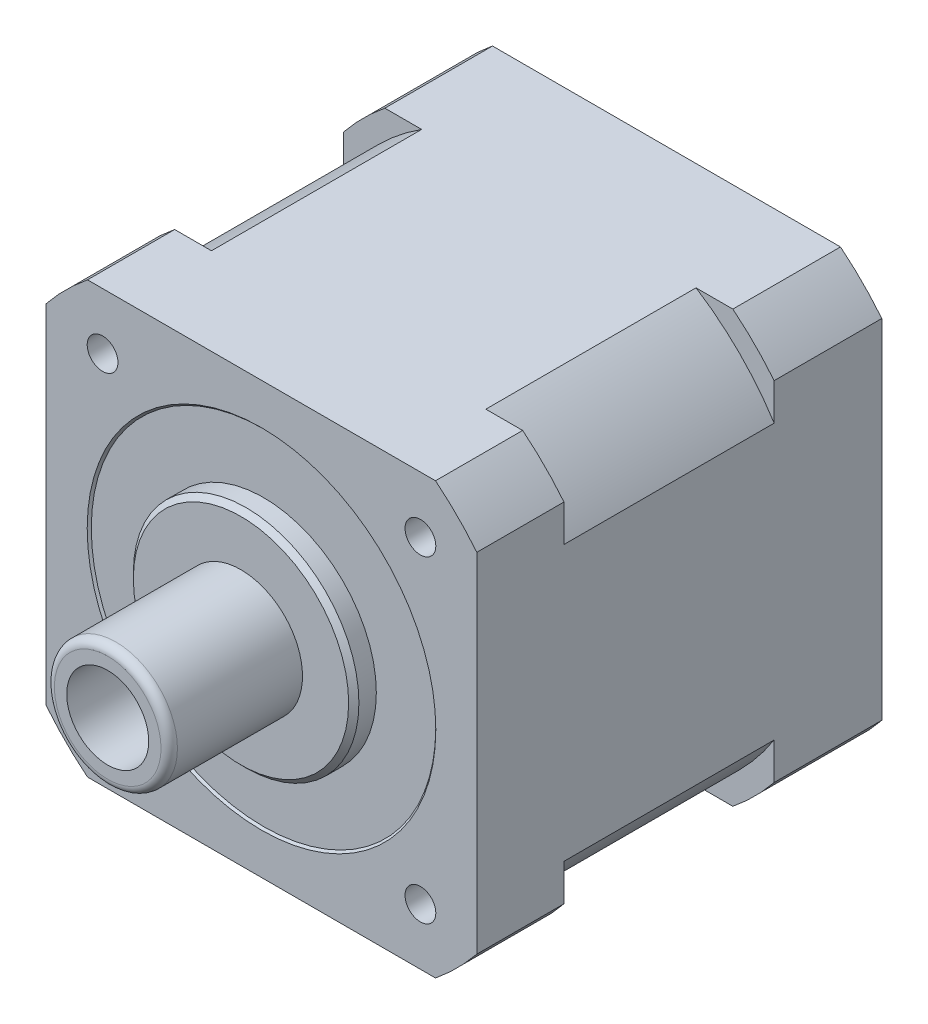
ISO-10303-21;
HEADER;
FILE_DESCRIPTION(('STEP AP214'),'2;1');
FILE_NAME('part.step','',(''),(''),'','','');
FILE_SCHEMA(('AUTOMOTIVE_DESIGN { 1 0 10303 214 1 1 1 1 }'));
ENDSEC;
DATA;
#1=APPLICATION_CONTEXT('core data for automotive mechanical design processes');
#2=APPLICATION_PROTOCOL_DEFINITION('international standard','automotive_design',2000,#1);
#3=PRODUCT_CONTEXT('',#1,'mechanical');
#4=PRODUCT('Part','Part','',(#3));
#5=PRODUCT_RELATED_PRODUCT_CATEGORY('part','',(#4));
#6=PRODUCT_DEFINITION_FORMATION('','',#4);
#7=PRODUCT_DEFINITION_CONTEXT('part definition',#1,'design');
#8=PRODUCT_DEFINITION('design','',#6,#7);
#9=PRODUCT_DEFINITION_SHAPE('','',#8);
#10=(LENGTH_UNIT() NAMED_UNIT(*) SI_UNIT(.MILLI.,.METRE.));
#11=(NAMED_UNIT(*) PLANE_ANGLE_UNIT() SI_UNIT($,.RADIAN.));
#12=(NAMED_UNIT(*) SI_UNIT($,.STERADIAN.) SOLID_ANGLE_UNIT());
#13=UNCERTAINTY_MEASURE_WITH_UNIT(LENGTH_MEASURE(1.E-05),#10,'distance_accuracy_value','');
#14=(GEOMETRIC_REPRESENTATION_CONTEXT(3) GLOBAL_UNCERTAINTY_ASSIGNED_CONTEXT((#13)) GLOBAL_UNIT_ASSIGNED_CONTEXT((#10,
#11,#12)) REPRESENTATION_CONTEXT('',''));
#15=CARTESIAN_POINT('',(0.,0.,0.));
#16=DIRECTION('',(0.,0.,1.));
#17=DIRECTION('',(1.,0.,0.));
#18=AXIS2_PLACEMENT_3D('',#15,#16,#17);
#19=CARTESIAN_POINT('',(0.,0.,-41.5));
#20=DIRECTION('',(0.,0.,-1.));
#21=DIRECTION('',(-1.,0.,0.));
#22=AXIS2_PLACEMENT_3D('',#19,#20,#21);
#23=PLANE('',#22);
#24=DIRECTION('',(0.,-1.,0.));
#25=VECTOR('',#24,1.);
#26=CARTESIAN_POINT('',(21.,0.,-41.5));
#27=LINE('',#26,#25);
#28=CARTESIAN_POINT('',(21.,16.9705627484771,-41.5));
#29=VERTEX_POINT('',#28);
#30=CARTESIAN_POINT('',(21.,-16.9705627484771,-41.5));
#31=VERTEX_POINT('',#30);
#32=EDGE_CURVE('E208',#29,#31,#27,.T.);
#33=ORIENTED_EDGE('',*,*,#32,.T.);
#34=CARTESIAN_POINT('',(0.,0.,-41.5));
#35=DIRECTION('',(0.,0.,-1.));
#36=DIRECTION('',(-1.,0.,0.));
#37=AXIS2_PLACEMENT_3D('',#34,#35,#36);
#38=CIRCLE('',#37,27.);
#39=CARTESIAN_POINT('',(16.9705627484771,-21.,-41.5));
#40=VERTEX_POINT('',#39);
#41=EDGE_CURVE('E198',#31,#40,#38,.T.);
#42=ORIENTED_EDGE('',*,*,#41,.T.);
#43=DIRECTION('',(-1.,0.,0.));
#44=VECTOR('',#43,1.);
#45=CARTESIAN_POINT('',(0.,-21.,-41.5));
#46=LINE('',#45,#44);
#47=CARTESIAN_POINT('',(-16.9705627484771,-21.,-41.5));
#48=VERTEX_POINT('',#47);
#49=EDGE_CURVE('E207',#40,#48,#46,.T.);
#50=ORIENTED_EDGE('',*,*,#49,.T.);
#51=CARTESIAN_POINT('',(0.,0.,-41.5));
#52=DIRECTION('',(0.,0.,-1.));
#53=DIRECTION('',(-1.,0.,0.));
#54=AXIS2_PLACEMENT_3D('',#51,#52,#53);
#55=CIRCLE('',#54,27.);
#56=CARTESIAN_POINT('',(-21.,-16.9705627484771,-41.5));
#57=VERTEX_POINT('',#56);
#58=EDGE_CURVE('E317',#48,#57,#55,.T.);
#59=ORIENTED_EDGE('',*,*,#58,.T.);
#60=DIRECTION('',(0.,1.,0.));
#61=VECTOR('',#60,1.);
#62=CARTESIAN_POINT('',(-21.,0.,-41.5));
#63=LINE('',#62,#61);
#64=CARTESIAN_POINT('',(-21.,16.9705627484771,-41.5));
#65=VERTEX_POINT('',#64);
#66=EDGE_CURVE('E335',#57,#65,#63,.T.);
#67=ORIENTED_EDGE('',*,*,#66,.T.);
#68=CARTESIAN_POINT('',(0.,0.,-41.5));
#69=DIRECTION('',(0.,0.,-1.));
#70=DIRECTION('',(-1.,0.,0.));
#71=AXIS2_PLACEMENT_3D('',#68,#69,#70);
#72=CIRCLE('',#71,27.);
#73=CARTESIAN_POINT('',(-16.9705627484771,21.,-41.5));
#74=VERTEX_POINT('',#73);
#75=EDGE_CURVE('E337',#65,#74,#72,.T.);
#76=ORIENTED_EDGE('',*,*,#75,.T.);
#77=DIRECTION('',(1.,0.,0.));
#78=VECTOR('',#77,1.);
#79=CARTESIAN_POINT('',(0.,21.,-41.5));
#80=LINE('',#79,#78);
#81=CARTESIAN_POINT('',(16.9705627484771,21.,-41.5));
#82=VERTEX_POINT('',#81);
#83=EDGE_CURVE('E302',#74,#82,#80,.T.);
#84=ORIENTED_EDGE('',*,*,#83,.T.);
#85=CARTESIAN_POINT('',(0.,0.,-41.5));
#86=DIRECTION('',(0.,0.,-1.));
#87=DIRECTION('',(-1.,0.,0.));
#88=AXIS2_PLACEMENT_3D('',#85,#86,#87);
#89=CIRCLE('',#88,27.);
#90=EDGE_CURVE('E213',#82,#29,#89,.T.);
#91=ORIENTED_EDGE('',*,*,#90,.T.);
#92=EDGE_LOOP('',(#33,#42,#50,#59,#67,#76,#84,#91));
#93=FACE_BOUND('',#92,.T.);
#94=CARTESIAN_POINT('',(0.,0.,-41.5));
#95=DIRECTION('',(0.,0.,-1.));
#96=DIRECTION('',(-1.,0.,0.));
#97=AXIS2_PLACEMENT_3D('',#94,#95,#96);
#98=CIRCLE('',#97,6.);
#99=CARTESIAN_POINT('',(-6.,0.,-41.5));
#100=VERTEX_POINT('',#99);
#101=EDGE_CURVE('E516',#100,#100,#98,.T.);
#102=ORIENTED_EDGE('',*,*,#101,.F.);
#103=EDGE_LOOP('',(#102));
#104=FACE_BOUND('',#103,.T.);
#105=ADVANCED_FACE('F36',(#93,#104),#23,.T.);
#106=CARTESIAN_POINT('',(0.,0.,13.));
#107=DIRECTION('',(0.,0.,-1.));
#108=DIRECTION('',(-1.,0.,0.));
#109=AXIS2_PLACEMENT_3D('',#106,#107,#108);
#110=CYLINDRICAL_SURFACE('',#109,6.);
#111=CARTESIAN_POINT('',(0.,0.,12.2));
#112=DIRECTION('',(0.,0.,1.));
#113=DIRECTION('',(1.,0.,0.));
#114=AXIS2_PLACEMENT_3D('',#111,#112,#113);
#115=CIRCLE('',#114,6.);
#116=CARTESIAN_POINT('',(-6.,0.,12.2));
#117=VERTEX_POINT('',#116);
#118=EDGE_CURVE('E12',#117,#117,#115,.F.);
#119=CARTESIAN_POINT('',(0.,0.,0.));
#120=DIRECTION('',(0.,0.,-1.));
#121=DIRECTION('',(-1.,0.,0.));
#122=AXIS2_PLACEMENT_3D('',#119,#120,#121);
#123=CIRCLE('',#122,6.);
#124=CARTESIAN_POINT('',(-6.,0.,0.));
#125=VERTEX_POINT('',#124);
#126=EDGE_CURVE('E431',#125,#125,#123,.T.);
#127=CARTESIAN_POINT('',(-6.,0.,12.2));
#128=CARTESIAN_POINT('',(-6.,0.,12.0729166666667));
#129=CARTESIAN_POINT('',(-6.,0.,11.9458333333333));
#130=CARTESIAN_POINT('',(-6.,0.,11.6916666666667));
#131=CARTESIAN_POINT('',(-6.,0.,11.5645833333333));
#132=CARTESIAN_POINT('',(-6.,0.,11.3104166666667));
#133=CARTESIAN_POINT('',(-6.,0.,11.1833333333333));
#134=CARTESIAN_POINT('',(-6.,0.,10.9291666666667));
#135=CARTESIAN_POINT('',(-6.,0.,10.8020833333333));
#136=CARTESIAN_POINT('',(-6.,0.,10.5479166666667));
#137=CARTESIAN_POINT('',(-6.,0.,10.4208333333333));
#138=CARTESIAN_POINT('',(-6.,0.,10.1666666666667));
#139=CARTESIAN_POINT('',(-6.,0.,10.0395833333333));
#140=CARTESIAN_POINT('',(-6.,0.,9.78541666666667));
#141=CARTESIAN_POINT('',(-6.,0.,9.65833333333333));
#142=CARTESIAN_POINT('',(-6.,0.,9.40416666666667));
#143=CARTESIAN_POINT('',(-6.,0.,9.27708333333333));
#144=CARTESIAN_POINT('',(-6.,0.,9.02291666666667));
#145=CARTESIAN_POINT('',(-6.,0.,8.89583333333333));
#146=CARTESIAN_POINT('',(-6.,0.,8.64166666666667));
#147=CARTESIAN_POINT('',(-6.,0.,8.51458333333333));
#148=CARTESIAN_POINT('',(-6.,0.,8.26041666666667));
#149=CARTESIAN_POINT('',(-6.,0.,8.13333333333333));
#150=CARTESIAN_POINT('',(-6.,0.,7.87916666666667));
#151=CARTESIAN_POINT('',(-6.,0.,7.75208333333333));
#152=CARTESIAN_POINT('',(-6.,0.,7.49791666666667));
#153=CARTESIAN_POINT('',(-6.,0.,7.37083333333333));
#154=CARTESIAN_POINT('',(-6.,0.,7.11666666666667));
#155=CARTESIAN_POINT('',(-6.,0.,6.98958333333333));
#156=CARTESIAN_POINT('',(-6.,0.,6.73541666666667));
#157=CARTESIAN_POINT('',(-6.,0.,6.60833333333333));
#158=CARTESIAN_POINT('',(-6.,0.,6.35416666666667));
#159=CARTESIAN_POINT('',(-6.,0.,6.22708333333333));
#160=CARTESIAN_POINT('',(-6.,0.,5.97291666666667));
#161=CARTESIAN_POINT('',(-6.,0.,5.84583333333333));
#162=CARTESIAN_POINT('',(-6.,0.,5.59166666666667));
#163=CARTESIAN_POINT('',(-6.,0.,5.46458333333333));
#164=CARTESIAN_POINT('',(-6.,0.,5.21041666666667));
#165=CARTESIAN_POINT('',(-6.,0.,5.08333333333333));
#166=CARTESIAN_POINT('',(-6.,0.,4.82916666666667));
#167=CARTESIAN_POINT('',(-6.,0.,4.70208333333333));
#168=CARTESIAN_POINT('',(-6.,0.,4.44791666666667));
#169=CARTESIAN_POINT('',(-6.,0.,4.32083333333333));
#170=CARTESIAN_POINT('',(-6.,0.,4.06666666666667));
#171=CARTESIAN_POINT('',(-6.,0.,3.93958333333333));
#172=CARTESIAN_POINT('',(-6.,0.,3.68541666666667));
#173=CARTESIAN_POINT('',(-6.,0.,3.55833333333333));
#174=CARTESIAN_POINT('',(-6.,0.,3.30416666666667));
#175=CARTESIAN_POINT('',(-6.,0.,3.17708333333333));
#176=CARTESIAN_POINT('',(-6.,0.,2.92291666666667));
#177=CARTESIAN_POINT('',(-6.,0.,2.79583333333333));
#178=CARTESIAN_POINT('',(-6.,0.,2.54166666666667));
#179=CARTESIAN_POINT('',(-6.,0.,2.41458333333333));
#180=CARTESIAN_POINT('',(-6.,0.,2.16041666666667));
#181=CARTESIAN_POINT('',(-6.,0.,2.03333333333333));
#182=CARTESIAN_POINT('',(-6.,0.,1.77916666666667));
#183=CARTESIAN_POINT('',(-6.,0.,1.65208333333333));
#184=CARTESIAN_POINT('',(-6.,0.,1.39791666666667));
#185=CARTESIAN_POINT('',(-6.,0.,1.27083333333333));
#186=CARTESIAN_POINT('',(-6.,0.,1.01666666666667));
#187=CARTESIAN_POINT('',(-6.,0.,0.889583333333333));
#188=CARTESIAN_POINT('',(-6.,0.,0.635416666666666));
#189=CARTESIAN_POINT('',(-6.,0.,0.508333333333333));
#190=CARTESIAN_POINT('',(-6.,0.,0.254166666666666));
#191=CARTESIAN_POINT('',(-6.,0.,0.127083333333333));
#192=CARTESIAN_POINT('',(-6.,0.,0.));
#193=B_SPLINE_CURVE_WITH_KNOTS('',3,(#127,#128,#129,#130,#131,#132,#133,#134,#135,#136,#137,
#138,#139,#140,#141,#142,#143,#144,#145,#146,#147,#148,#149,#150,#151,#152,#153,#154,#155,#156,
#157,#158,#159,#160,#161,#162,#163,#164,#165,#166,#167,#168,#169,#170,#171,#172,#173,#174,#175,
#176,#177,#178,#179,#180,#181,#182,#183,#184,#185,#186,#187,#188,#189,#190,#191,#192),
.UNSPECIFIED.,.F.,.F.,(4,2,2,2,2,2,2,2,2,2,2,2,2,2,2,2,2,2,2,2,2,2,2,2,2,2,2,2,2,2,2,2,4),(0.,
0.38125,0.762499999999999,1.14375,1.525,1.90625,2.2875,2.66875,3.05,3.43125,3.8125,4.19375,
4.575,4.95625,5.3375,5.71875,6.1,6.48125,6.8625,7.24375,7.625,8.00625,8.3875,8.76875,9.15,
9.53125,9.9125,10.29375,10.675,11.05625,11.4375,11.81875,12.2),.UNSPECIFIED.);
#194=EDGE_CURVE('BSEAM537',#117,#125,#193,.T.);
#195=ORIENTED_EDGE('',*,*,#118,.T.);
#196=ORIENTED_EDGE('',*,*,#126,.F.);
#197=ORIENTED_EDGE('',*,*,#194,.T.);
#198=ORIENTED_EDGE('',*,*,#194,.F.);
#199=EDGE_LOOP('',(#195,#197,#196,#198));
#200=FACE_BOUND('',#199,.T.);
#201=ADVANCED_FACE('F537',(#200),#110,.T.);
#202=CARTESIAN_POINT('',(0.,0.,13.));
#203=DIRECTION('',(0.,0.,1.));
#204=DIRECTION('',(1.,0.,0.));
#205=AXIS2_PLACEMENT_3D('',#202,#203,#204);
#206=PLANE('',#205);
#207=CARTESIAN_POINT('',(0.,0.,13.));
#208=DIRECTION('',(0.,0.,1.));
#209=DIRECTION('',(1.,0.,0.));
#210=AXIS2_PLACEMENT_3D('',#207,#208,#209);
#211=CIRCLE('',#210,4.);
#212=CARTESIAN_POINT('',(4.,0.,13.));
#213=VERTEX_POINT('',#212);
#214=EDGE_CURVE('E526',#213,#213,#211,.T.);
#215=ORIENTED_EDGE('',*,*,#214,.F.);
#216=EDGE_LOOP('',(#215));
#217=FACE_BOUND('',#216,.T.);
#218=CARTESIAN_POINT('',(0.,0.,13.));
#219=DIRECTION('',(0.,0.,1.));
#220=DIRECTION('',(1.,0.,0.));
#221=AXIS2_PLACEMENT_3D('',#218,#219,#220);
#222=CIRCLE('',#221,5.2);
#223=CARTESIAN_POINT('',(5.2,0.,13.));
#224=VERTEX_POINT('',#223);
#225=EDGE_CURVE('E44',#224,#224,#222,.T.);
#226=ORIENTED_EDGE('',*,*,#225,.T.);
#227=EDGE_LOOP('',(#226));
#228=FACE_BOUND('',#227,.T.);
#229=ADVANCED_FACE('F533',(#217,#228),#206,.T.);
#230=CARTESIAN_POINT('',(0.,0.,0.));
#231=DIRECTION('',(0.,0.,-1.));
#232=DIRECTION('',(-1.,0.,0.));
#233=AXIS2_PLACEMENT_3D('',#230,#231,#232);
#234=PLANE('',#233);
#235=CARTESIAN_POINT('',(0.,0.,0.));
#236=DIRECTION('',(0.,0.,-1.));
#237=DIRECTION('',(-1.,0.,0.));
#238=AXIS2_PLACEMENT_3D('',#235,#236,#237);
#239=CIRCLE('',#238,10.5);
#240=CARTESIAN_POINT('',(-10.5,0.,0.));
#241=VERTEX_POINT('',#240);
#242=EDGE_CURVE('E549',#241,#241,#239,.F.);
#243=ORIENTED_EDGE('',*,*,#242,.T.);
#244=EDGE_LOOP('',(#243));
#245=FACE_BOUND('',#244,.T.);
#246=ORIENTED_EDGE('',*,*,#126,.T.);
#247=EDGE_LOOP('',(#246));
#248=FACE_BOUND('',#247,.T.);
#249=ADVANCED_FACE('F536',(#245,#248),#234,.F.);
#250=CARTESIAN_POINT('',(0.,0.,-2.));
#251=DIRECTION('',(0.,0.,1.));
#252=DIRECTION('',(1.,0.,0.));
#253=AXIS2_PLACEMENT_3D('',#250,#251,#252);
#254=CYLINDRICAL_SURFACE('',#253,11.);
#255=CARTESIAN_POINT('',(0.,0.,-0.499999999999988));
#256=DIRECTION('',(0.,0.,-1.));
#257=DIRECTION('',(-1.,0.,0.));
#258=AXIS2_PLACEMENT_3D('',#255,#256,#257);
#259=CIRCLE('',#258,11.);
#260=CARTESIAN_POINT('',(-11.,0.,-0.499999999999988));
#261=VERTEX_POINT('',#260);
#262=EDGE_CURVE('E552',#261,#261,#259,.T.);
#263=ORIENTED_EDGE('',*,*,#262,.T.);
#264=EDGE_LOOP('',(#263));
#265=FACE_BOUND('',#264,.T.);
#266=CARTESIAN_POINT('',(0.,0.,-2.2));
#267=DIRECTION('',(0.,0.,1.));
#268=DIRECTION('',(1.,0.,0.));
#269=AXIS2_PLACEMENT_3D('',#266,#267,#268);
#270=CIRCLE('',#269,11.);
#271=CARTESIAN_POINT('',(11.,0.,-2.2));
#272=VERTEX_POINT('',#271);
#273=EDGE_CURVE('E514',#272,#272,#270,.T.);
#274=ORIENTED_EDGE('',*,*,#273,.T.);
#275=EDGE_LOOP('',(#274));
#276=FACE_BOUND('',#275,.T.);
#277=ADVANCED_FACE('F671',(#265,#276),#254,.T.);
#278=CARTESIAN_POINT('',(0.,0.,-2.2));
#279=DIRECTION('',(0.,0.,1.));
#280=DIRECTION('',(1.,0.,0.));
#281=AXIS2_PLACEMENT_3D('',#278,#279,#280);
#282=PLANE('',#281);
#283=CARTESIAN_POINT('',(0.,0.,-2.2));
#284=DIRECTION('',(0.,0.,1.));
#285=DIRECTION('',(1.,0.,0.));
#286=AXIS2_PLACEMENT_3D('',#283,#284,#285);
#287=CIRCLE('',#286,16.8);
#288=CARTESIAN_POINT('',(16.8,0.,-2.2));
#289=VERTEX_POINT('',#288);
#290=EDGE_CURVE('E555',#289,#289,#287,.T.);
#291=ORIENTED_EDGE('',*,*,#290,.T.);
#292=EDGE_LOOP('',(#291));
#293=FACE_BOUND('',#292,.T.);
#294=ORIENTED_EDGE('',*,*,#273,.F.);
#295=EDGE_LOOP('',(#294));
#296=FACE_BOUND('',#295,.T.);
#297=ADVANCED_FACE('F627',(#293,#296),#282,.T.);
#298=CARTESIAN_POINT('',(-21.,-21.,-10.5));
#299=DIRECTION('',(0.,0.,-1.));
#300=DIRECTION('',(-1.,0.,0.));
#301=AXIS2_PLACEMENT_3D('',#298,#299,#300);
#302=PLANE('',#301);
#303=CARTESIAN_POINT('',(0.,0.,-10.5));
#304=DIRECTION('',(0.,0.,-1.));
#305=DIRECTION('',(-1.,0.,0.));
#306=AXIS2_PLACEMENT_3D('',#303,#304,#305);
#307=CIRCLE('',#306,24.9);
#308=CARTESIAN_POINT('',(13.3794618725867,21.,-10.5));
#309=VERTEX_POINT('',#308);
#310=CARTESIAN_POINT('',(21.,13.3794618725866,-10.5));
#311=VERTEX_POINT('',#310);
#312=EDGE_CURVE('E384',#309,#311,#307,.T.);
#313=ORIENTED_EDGE('',*,*,#312,.F.);
#314=DIRECTION('',(1.,0.,0.));
#315=VECTOR('',#314,1.);
#316=CARTESIAN_POINT('',(21.,21.,-10.5));
#317=LINE('',#316,#315);
#318=CARTESIAN_POINT('',(16.9705627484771,21.,-10.5));
#319=VERTEX_POINT('',#318);
#320=EDGE_CURVE('E426',#309,#319,#317,.T.);
#321=ORIENTED_EDGE('',*,*,#320,.T.);
#322=CARTESIAN_POINT('',(0.,0.,-10.5));
#323=DIRECTION('',(0.,0.,-1.));
#324=DIRECTION('',(-1.,0.,0.));
#325=AXIS2_PLACEMENT_3D('',#322,#323,#324);
#326=CIRCLE('',#325,27.);
#327=CARTESIAN_POINT('',(21.,16.9705627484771,-10.5));
#328=VERTEX_POINT('',#327);
#329=EDGE_CURVE('E490',#319,#328,#326,.T.);
#330=ORIENTED_EDGE('',*,*,#329,.T.);
#331=DIRECTION('',(0.,-1.,0.));
#332=VECTOR('',#331,1.);
#333=CARTESIAN_POINT('',(21.,21.,-10.5));
#334=LINE('',#333,#332);
#335=EDGE_CURVE('E456',#328,#311,#334,.T.);
#336=ORIENTED_EDGE('',*,*,#335,.T.);
#337=EDGE_LOOP('',(#313,#321,#330,#336));
#338=FACE_BOUND('',#337,.T.);
#339=ADVANCED_FACE('F483',(#338),#302,.T.);
#340=CARTESIAN_POINT('',(0.,0.,-31.));
#341=DIRECTION('',(0.,0.,1.));
#342=DIRECTION('',(1.,0.,0.));
#343=AXIS2_PLACEMENT_3D('',#340,#341,#342);
#344=CYLINDRICAL_SURFACE('',#343,24.9);
#345=ORIENTED_EDGE('',*,*,#312,.T.);
#346=DIRECTION('',(0.,0.,1.));
#347=VECTOR('',#346,1.);
#348=CARTESIAN_POINT('',(21.,13.3794618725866,-31.));
#349=LINE('',#348,#347);
#350=CARTESIAN_POINT('',(21.,13.3794618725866,-31.));
#351=VERTEX_POINT('',#350);
#352=EDGE_CURVE('E301',#351,#311,#349,.T.);
#353=ORIENTED_EDGE('',*,*,#352,.F.);
#354=CARTESIAN_POINT('',(0.,0.,-31.));
#355=DIRECTION('',(0.,0.,-1.));
#356=DIRECTION('',(-1.,0.,0.));
#357=AXIS2_PLACEMENT_3D('',#354,#355,#356);
#358=CIRCLE('',#357,24.9);
#359=CARTESIAN_POINT('',(13.3794618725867,21.,-31.));
#360=VERTEX_POINT('',#359);
#361=EDGE_CURVE('E298',#360,#351,#358,.T.);
#362=ORIENTED_EDGE('',*,*,#361,.F.);
#363=DIRECTION('',(0.,0.,1.));
#364=VECTOR('',#363,1.);
#365=CARTESIAN_POINT('',(13.3794618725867,21.,-31.));
#366=LINE('',#365,#364);
#367=EDGE_CURVE('E286',#360,#309,#366,.T.);
#368=ORIENTED_EDGE('',*,*,#367,.T.);
#369=EDGE_LOOP('',(#345,#353,#362,#368));
#370=FACE_BOUND('',#369,.T.);
#371=ADVANCED_FACE('F481',(#370),#344,.T.);
#372=CARTESIAN_POINT('',(0.,0.,-31.));
#373=DIRECTION('',(0.,0.,-1.));
#374=DIRECTION('',(-1.,0.,0.));
#375=AXIS2_PLACEMENT_3D('',#372,#373,#374);
#376=PLANE('',#375);
#377=DIRECTION('',(1.,0.,0.));
#378=VECTOR('',#377,1.);
#379=CARTESIAN_POINT('',(0.,21.,-31.));
#380=LINE('',#379,#378);
#381=CARTESIAN_POINT('',(16.9705627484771,21.,-31.));
#382=VERTEX_POINT('',#381);
#383=EDGE_CURVE('E266',#360,#382,#380,.T.);
#384=ORIENTED_EDGE('',*,*,#383,.F.);
#385=ORIENTED_EDGE('',*,*,#361,.T.);
#386=DIRECTION('',(0.,-1.,0.));
#387=VECTOR('',#386,1.);
#388=CARTESIAN_POINT('',(21.,0.,-31.));
#389=LINE('',#388,#387);
#390=CARTESIAN_POINT('',(21.,16.9705627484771,-31.));
#391=VERTEX_POINT('',#390);
#392=EDGE_CURVE('E233',#391,#351,#389,.T.);
#393=ORIENTED_EDGE('',*,*,#392,.F.);
#394=CARTESIAN_POINT('',(0.,0.,-31.));
#395=DIRECTION('',(0.,0.,-1.));
#396=DIRECTION('',(-1.,0.,0.));
#397=AXIS2_PLACEMENT_3D('',#394,#395,#396);
#398=CIRCLE('',#397,27.);
#399=EDGE_CURVE('E217',#382,#391,#398,.T.);
#400=ORIENTED_EDGE('',*,*,#399,.F.);
#401=EDGE_LOOP('',(#384,#385,#393,#400));
#402=FACE_BOUND('',#401,.T.);
#403=ADVANCED_FACE('F297',(#402),#376,.F.);
#404=CARTESIAN_POINT('',(0.,0.,-41.5));
#405=DIRECTION('',(0.,0.,1.));
#406=DIRECTION('',(1.,0.,0.));
#407=AXIS2_PLACEMENT_3D('',#404,#405,#406);
#408=CYLINDRICAL_SURFACE('',#407,27.);
#409=ORIENTED_EDGE('',*,*,#399,.T.);
#410=DIRECTION('',(0.,0.,1.));
#411=VECTOR('',#410,1.);
#412=CARTESIAN_POINT('',(21.,16.9705627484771,-41.5));
#413=LINE('',#412,#411);
#414=EDGE_CURVE('E294',#29,#391,#413,.T.);
#415=ORIENTED_EDGE('',*,*,#414,.F.);
#416=ORIENTED_EDGE('',*,*,#90,.F.);
#417=DIRECTION('',(0.,0.,1.));
#418=VECTOR('',#417,1.);
#419=CARTESIAN_POINT('',(16.9705627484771,21.,-41.5));
#420=LINE('',#419,#418);
#421=EDGE_CURVE('E283',#82,#382,#420,.T.);
#422=ORIENTED_EDGE('',*,*,#421,.T.);
#423=EDGE_LOOP('',(#409,#415,#416,#422));
#424=FACE_BOUND('',#423,.T.);
#425=ADVANCED_FACE('F292',(#424),#408,.T.);
#426=CARTESIAN_POINT('',(0.,0.,-10.5));
#427=DIRECTION('',(0.,0.,-1.));
#428=DIRECTION('',(-1.,0.,0.));
#429=AXIS2_PLACEMENT_3D('',#426,#427,#428);
#430=CIRCLE('',#429,24.9);
#431=CARTESIAN_POINT('',(21.,-13.3794618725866,-10.5));
#432=VERTEX_POINT('',#431);
#433=CARTESIAN_POINT('',(13.3794618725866,-21.,-10.5));
#434=VERTEX_POINT('',#433);
#435=EDGE_CURVE('E373',#432,#434,#430,.T.);
#436=ORIENTED_EDGE('',*,*,#435,.F.);
#437=CARTESIAN_POINT('',(21.,-16.9705627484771,-10.5));
#438=VERTEX_POINT('',#437);
#439=EDGE_CURVE('E454',#432,#438,#334,.T.);
#440=ORIENTED_EDGE('',*,*,#439,.T.);
#441=CARTESIAN_POINT('',(16.9705627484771,-21.,-10.5));
#442=VERTEX_POINT('',#441);
#443=EDGE_CURVE('E430',#438,#442,#326,.T.);
#444=ORIENTED_EDGE('',*,*,#443,.T.);
#445=DIRECTION('',(-1.,0.,0.));
#446=VECTOR('',#445,1.);
#447=CARTESIAN_POINT('',(21.,-21.,-10.5));
#448=LINE('',#447,#446);
#449=EDGE_CURVE('E59',#442,#434,#448,.T.);
#450=ORIENTED_EDGE('',*,*,#449,.T.);
#451=EDGE_LOOP('',(#436,#440,#444,#450));
#452=FACE_BOUND('',#451,.T.);
#453=ADVANCED_FACE('F500',(#452),#302,.T.);
#454=CARTESIAN_POINT('',(0.,0.,-31.));
#455=DIRECTION('',(0.,0.,1.));
#456=DIRECTION('',(1.,0.,0.));
#457=AXIS2_PLACEMENT_3D('',#454,#455,#456);
#458=CYLINDRICAL_SURFACE('',#457,24.9);
#459=ORIENTED_EDGE('',*,*,#435,.T.);
#460=DIRECTION('',(0.,0.,1.));
#461=VECTOR('',#460,1.);
#462=CARTESIAN_POINT('',(13.3794618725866,-21.,-31.));
#463=LINE('',#462,#461);
#464=CARTESIAN_POINT('',(13.3794618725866,-21.,-31.));
#465=VERTEX_POINT('',#464);
#466=EDGE_CURVE('E505',#465,#434,#463,.T.);
#467=ORIENTED_EDGE('',*,*,#466,.F.);
#468=CARTESIAN_POINT('',(0.,0.,-31.));
#469=DIRECTION('',(0.,0.,-1.));
#470=DIRECTION('',(-1.,0.,0.));
#471=AXIS2_PLACEMENT_3D('',#468,#469,#470);
#472=CIRCLE('',#471,24.9);
#473=CARTESIAN_POINT('',(21.,-13.3794618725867,-31.));
#474=VERTEX_POINT('',#473);
#475=EDGE_CURVE('E356',#474,#465,#472,.T.);
#476=ORIENTED_EDGE('',*,*,#475,.F.);
#477=DIRECTION('',(0.,0.,1.));
#478=VECTOR('',#477,1.);
#479=CARTESIAN_POINT('',(21.,-13.3794618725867,-31.));
#480=LINE('',#479,#478);
#481=EDGE_CURVE('E354',#474,#432,#480,.T.);
#482=ORIENTED_EDGE('',*,*,#481,.T.);
#483=EDGE_LOOP('',(#459,#467,#476,#482));
#484=FACE_BOUND('',#483,.T.);
#485=ADVANCED_FACE('F511',(#484),#458,.T.);
#486=CARTESIAN_POINT('',(21.,-16.9705627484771,-31.));
#487=VERTEX_POINT('',#486);
#488=EDGE_CURVE('E222',#474,#487,#389,.T.);
#489=ORIENTED_EDGE('',*,*,#488,.F.);
#490=ORIENTED_EDGE('',*,*,#475,.T.);
#491=DIRECTION('',(-1.,0.,0.));
#492=VECTOR('',#491,1.);
#493=CARTESIAN_POINT('',(0.,-21.,-31.));
#494=LINE('',#493,#492);
#495=CARTESIAN_POINT('',(16.9705627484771,-21.,-31.));
#496=VERTEX_POINT('',#495);
#497=EDGE_CURVE('E254',#496,#465,#494,.T.);
#498=ORIENTED_EDGE('',*,*,#497,.F.);
#499=CARTESIAN_POINT('',(0.,0.,-31.));
#500=DIRECTION('',(0.,0.,-1.));
#501=DIRECTION('',(-1.,0.,0.));
#502=AXIS2_PLACEMENT_3D('',#499,#500,#501);
#503=CIRCLE('',#502,27.);
#504=EDGE_CURVE('E237',#487,#496,#503,.T.);
#505=ORIENTED_EDGE('',*,*,#504,.F.);
#506=EDGE_LOOP('',(#489,#490,#498,#505));
#507=FACE_BOUND('',#506,.T.);
#508=ADVANCED_FACE('F513',(#507),#376,.F.);
#509=CARTESIAN_POINT('',(0.,0.,-41.5));
#510=DIRECTION('',(0.,0.,1.));
#511=DIRECTION('',(1.,0.,0.));
#512=AXIS2_PLACEMENT_3D('',#509,#510,#511);
#513=CYLINDRICAL_SURFACE('',#512,27.);
#514=ORIENTED_EDGE('',*,*,#504,.T.);
#515=DIRECTION('',(0.,0.,1.));
#516=VECTOR('',#515,1.);
#517=CARTESIAN_POINT('',(16.9705627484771,-21.,-41.5));
#518=LINE('',#517,#516);
#519=EDGE_CURVE('E204',#40,#496,#518,.T.);
#520=ORIENTED_EDGE('',*,*,#519,.F.);
#521=ORIENTED_EDGE('',*,*,#41,.F.);
#522=DIRECTION('',(0.,0.,1.));
#523=VECTOR('',#522,1.);
#524=CARTESIAN_POINT('',(21.,-16.9705627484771,-41.5));
#525=LINE('',#524,#523);
#526=EDGE_CURVE('E202',#31,#487,#525,.T.);
#527=ORIENTED_EDGE('',*,*,#526,.T.);
#528=EDGE_LOOP('',(#514,#520,#521,#527));
#529=FACE_BOUND('',#528,.T.);
#530=ADVANCED_FACE('F200',(#529),#513,.T.);
#531=CARTESIAN_POINT('',(0.,0.,-10.5));
#532=DIRECTION('',(0.,0.,-1.));
#533=DIRECTION('',(-1.,0.,0.));
#534=AXIS2_PLACEMENT_3D('',#531,#532,#533);
#535=CIRCLE('',#534,24.9);
#536=CARTESIAN_POINT('',(-13.3794618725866,-21.,-10.5));
#537=VERTEX_POINT('',#536);
#538=CARTESIAN_POINT('',(-21.,-13.3794618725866,-10.5));
#539=VERTEX_POINT('',#538);
#540=EDGE_CURVE('E51',#537,#539,#535,.T.);
#541=ORIENTED_EDGE('',*,*,#540,.F.);
#542=CARTESIAN_POINT('',(-16.9705627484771,-21.,-10.5));
#543=VERTEX_POINT('',#542);
#544=EDGE_CURVE('E450',#537,#543,#448,.T.);
#545=ORIENTED_EDGE('',*,*,#544,.T.);
#546=CARTESIAN_POINT('',(-21.,-16.9705627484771,-10.5));
#547=VERTEX_POINT('',#546);
#548=EDGE_CURVE('E427',#543,#547,#326,.T.);
#549=ORIENTED_EDGE('',*,*,#548,.T.);
#550=DIRECTION('',(0.,1.,0.));
#551=VECTOR('',#550,1.);
#552=CARTESIAN_POINT('',(-21.,21.,-10.5));
#553=LINE('',#552,#551);
#554=EDGE_CURVE('E424',#547,#539,#553,.T.);
#555=ORIENTED_EDGE('',*,*,#554,.T.);
#556=EDGE_LOOP('',(#541,#545,#549,#555));
#557=FACE_BOUND('',#556,.T.);
#558=ADVANCED_FACE('F640',(#557),#302,.T.);
#559=CARTESIAN_POINT('',(0.,0.,-31.));
#560=DIRECTION('',(0.,0.,1.));
#561=DIRECTION('',(1.,0.,0.));
#562=AXIS2_PLACEMENT_3D('',#559,#560,#561);
#563=CYLINDRICAL_SURFACE('',#562,24.9);
#564=ORIENTED_EDGE('',*,*,#540,.T.);
#565=DIRECTION('',(0.,0.,1.));
#566=VECTOR('',#565,1.);
#567=CARTESIAN_POINT('',(-21.,-13.3794618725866,-31.));
#568=LINE('',#567,#566);
#569=CARTESIAN_POINT('',(-21.,-13.3794618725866,-31.));
#570=VERTEX_POINT('',#569);
#571=EDGE_CURVE('E332',#570,#539,#568,.T.);
#572=ORIENTED_EDGE('',*,*,#571,.F.);
#573=CARTESIAN_POINT('',(0.,0.,-31.));
#574=DIRECTION('',(0.,0.,-1.));
#575=DIRECTION('',(-1.,0.,0.));
#576=AXIS2_PLACEMENT_3D('',#573,#574,#575);
#577=CIRCLE('',#576,24.9);
#578=CARTESIAN_POINT('',(-13.3794618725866,-21.,-31.));
#579=VERTEX_POINT('',#578);
#580=EDGE_CURVE('E326',#579,#570,#577,.T.);
#581=ORIENTED_EDGE('',*,*,#580,.F.);
#582=DIRECTION('',(0.,0.,1.));
#583=VECTOR('',#582,1.);
#584=CARTESIAN_POINT('',(-13.3794618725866,-21.,-31.));
#585=LINE('',#584,#583);
#586=EDGE_CURVE('E510',#579,#537,#585,.T.);
#587=ORIENTED_EDGE('',*,*,#586,.T.);
#588=EDGE_LOOP('',(#564,#572,#581,#587));
#589=FACE_BOUND('',#588,.T.);
#590=ADVANCED_FACE('F665',(#589),#563,.T.);
#591=CARTESIAN_POINT('',(-16.9705627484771,-21.,-31.));
#592=VERTEX_POINT('',#591);
#593=EDGE_CURVE('E245',#579,#592,#494,.T.);
#594=ORIENTED_EDGE('',*,*,#593,.F.);
#595=ORIENTED_EDGE('',*,*,#580,.T.);
#596=DIRECTION('',(0.,1.,0.));
#597=VECTOR('',#596,1.);
#598=CARTESIAN_POINT('',(-21.,0.,-31.));
#599=LINE('',#598,#597);
#600=CARTESIAN_POINT('',(-21.,-16.9705627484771,-31.));
#601=VERTEX_POINT('',#600);
#602=EDGE_CURVE('E259',#601,#570,#599,.T.);
#603=ORIENTED_EDGE('',*,*,#602,.F.);
#604=CARTESIAN_POINT('',(0.,0.,-31.));
#605=DIRECTION('',(0.,0.,-1.));
#606=DIRECTION('',(-1.,0.,0.));
#607=AXIS2_PLACEMENT_3D('',#604,#605,#606);
#608=CIRCLE('',#607,27.);
#609=EDGE_CURVE('E248',#592,#601,#608,.T.);
#610=ORIENTED_EDGE('',*,*,#609,.F.);
#611=EDGE_LOOP('',(#594,#595,#603,#610));
#612=FACE_BOUND('',#611,.T.);
#613=ADVANCED_FACE('F322',(#612),#376,.F.);
#614=CARTESIAN_POINT('',(0.,0.,-41.5));
#615=DIRECTION('',(0.,0.,1.));
#616=DIRECTION('',(1.,0.,0.));
#617=AXIS2_PLACEMENT_3D('',#614,#615,#616);
#618=CYLINDRICAL_SURFACE('',#617,27.);
#619=ORIENTED_EDGE('',*,*,#609,.T.);
#620=DIRECTION('',(0.,0.,1.));
#621=VECTOR('',#620,1.);
#622=CARTESIAN_POINT('',(-21.,-16.9705627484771,-41.5));
#623=LINE('',#622,#621);
#624=EDGE_CURVE('E308',#57,#601,#623,.T.);
#625=ORIENTED_EDGE('',*,*,#624,.F.);
#626=ORIENTED_EDGE('',*,*,#58,.F.);
#627=DIRECTION('',(0.,0.,1.));
#628=VECTOR('',#627,1.);
#629=CARTESIAN_POINT('',(-16.9705627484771,-21.,-41.5));
#630=LINE('',#629,#628);
#631=EDGE_CURVE('E229',#48,#592,#630,.T.);
#632=ORIENTED_EDGE('',*,*,#631,.T.);
#633=EDGE_LOOP('',(#619,#625,#626,#632));
#634=FACE_BOUND('',#633,.T.);
#635=ADVANCED_FACE('F315',(#634),#618,.T.);
#636=CARTESIAN_POINT('',(0.,0.,-41.5));
#637=DIRECTION('',(0.,0.,1.));
#638=DIRECTION('',(1.,0.,0.));
#639=AXIS2_PLACEMENT_3D('',#636,#637,#638);
#640=CYLINDRICAL_SURFACE('',#639,27.);
#641=CARTESIAN_POINT('',(0.,0.,-31.));
#642=DIRECTION('',(0.,0.,-1.));
#643=DIRECTION('',(-1.,0.,0.));
#644=AXIS2_PLACEMENT_3D('',#641,#642,#643);
#645=CIRCLE('',#644,27.);
#646=CARTESIAN_POINT('',(-21.,16.9705627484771,-31.));
#647=VERTEX_POINT('',#646);
#648=CARTESIAN_POINT('',(-16.9705627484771,21.,-31.));
#649=VERTEX_POINT('',#648);
#650=EDGE_CURVE('E263',#647,#649,#645,.T.);
#651=ORIENTED_EDGE('',*,*,#650,.T.);
#652=DIRECTION('',(0.,0.,1.));
#653=VECTOR('',#652,1.);
#654=CARTESIAN_POINT('',(-16.9705627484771,21.,-41.5));
#655=LINE('',#654,#653);
#656=EDGE_CURVE('E293',#74,#649,#655,.T.);
#657=ORIENTED_EDGE('',*,*,#656,.F.);
#658=ORIENTED_EDGE('',*,*,#75,.F.);
#659=DIRECTION('',(0.,0.,1.));
#660=VECTOR('',#659,1.);
#661=CARTESIAN_POINT('',(-21.,16.9705627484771,-41.5));
#662=LINE('',#661,#660);
#663=EDGE_CURVE('E305',#65,#647,#662,.T.);
#664=ORIENTED_EDGE('',*,*,#663,.T.);
#665=EDGE_LOOP('',(#651,#657,#658,#664));
#666=FACE_BOUND('',#665,.T.);
#667=ADVANCED_FACE('F633',(#666),#640,.T.);
#668=CARTESIAN_POINT('',(-21.,13.3794618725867,-31.));
#669=VERTEX_POINT('',#668);
#670=EDGE_CURVE('E257',#669,#647,#599,.T.);
#671=ORIENTED_EDGE('',*,*,#670,.F.);
#672=CARTESIAN_POINT('',(0.,0.,-31.));
#673=DIRECTION('',(0.,0.,-1.));
#674=DIRECTION('',(-1.,0.,0.));
#675=AXIS2_PLACEMENT_3D('',#672,#673,#674);
#676=CIRCLE('',#675,24.9);
#677=CARTESIAN_POINT('',(-13.3794618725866,21.,-31.));
#678=VERTEX_POINT('',#677);
#679=EDGE_CURVE('E350',#669,#678,#676,.T.);
#680=ORIENTED_EDGE('',*,*,#679,.T.);
#681=EDGE_CURVE('E271',#649,#678,#380,.T.);
#682=ORIENTED_EDGE('',*,*,#681,.F.);
#683=ORIENTED_EDGE('',*,*,#650,.F.);
#684=EDGE_LOOP('',(#671,#680,#682,#683));
#685=FACE_BOUND('',#684,.T.);
#686=ADVANCED_FACE('F348',(#685),#376,.F.);
#687=CARTESIAN_POINT('',(0.,0.,-31.));
#688=DIRECTION('',(0.,0.,1.));
#689=DIRECTION('',(1.,0.,0.));
#690=AXIS2_PLACEMENT_3D('',#687,#688,#689);
#691=CYLINDRICAL_SURFACE('',#690,24.9);
#692=CARTESIAN_POINT('',(0.,0.,-10.5));
#693=DIRECTION('',(0.,0.,-1.));
#694=DIRECTION('',(-1.,0.,0.));
#695=AXIS2_PLACEMENT_3D('',#692,#693,#694);
#696=CIRCLE('',#695,24.9);
#697=CARTESIAN_POINT('',(-21.,13.3794618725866,-10.5));
#698=VERTEX_POINT('',#697);
#699=CARTESIAN_POINT('',(-13.3794618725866,21.,-10.5));
#700=VERTEX_POINT('',#699);
#701=EDGE_CURVE('E388',#698,#700,#696,.T.);
#702=ORIENTED_EDGE('',*,*,#701,.T.);
#703=DIRECTION('',(0.,0.,1.));
#704=VECTOR('',#703,1.);
#705=CARTESIAN_POINT('',(-13.3794618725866,21.,-31.));
#706=LINE('',#705,#704);
#707=EDGE_CURVE('E468',#678,#700,#706,.T.);
#708=ORIENTED_EDGE('',*,*,#707,.F.);
#709=ORIENTED_EDGE('',*,*,#679,.F.);
#710=DIRECTION('',(0.,0.,1.));
#711=VECTOR('',#710,1.);
#712=CARTESIAN_POINT('',(-21.,13.3794618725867,-31.));
#713=LINE('',#712,#711);
#714=EDGE_CURVE('E469',#669,#698,#713,.T.);
#715=ORIENTED_EDGE('',*,*,#714,.T.);
#716=EDGE_LOOP('',(#702,#708,#709,#715));
#717=FACE_BOUND('',#716,.T.);
#718=ADVANCED_FACE('F467',(#717),#691,.T.);
#719=ORIENTED_EDGE('',*,*,#701,.F.);
#720=CARTESIAN_POINT('',(-21.,16.9705627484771,-10.5));
#721=VERTEX_POINT('',#720);
#722=EDGE_CURVE('E421',#698,#721,#553,.T.);
#723=ORIENTED_EDGE('',*,*,#722,.T.);
#724=CARTESIAN_POINT('',(-16.9705627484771,21.,-10.5));
#725=VERTEX_POINT('',#724);
#726=EDGE_CURVE('E432',#721,#725,#326,.T.);
#727=ORIENTED_EDGE('',*,*,#726,.T.);
#728=EDGE_CURVE('E457',#725,#700,#317,.T.);
#729=ORIENTED_EDGE('',*,*,#728,.T.);
#730=EDGE_LOOP('',(#719,#723,#727,#729));
#731=FACE_BOUND('',#730,.T.);
#732=ADVANCED_FACE('F463',(#731),#302,.T.);
#733=CARTESIAN_POINT('',(-15.5,15.5,-6.5));
#734=DIRECTION('',(0.,0.,1.));
#735=DIRECTION('',(1.,0.,0.));
#736=AXIS2_PLACEMENT_3D('',#733,#734,#735);
#737=PLANE('',#736);
#738=CARTESIAN_POINT('',(-15.5,15.5,-6.5));
#739=DIRECTION('',(0.,0.,1.));
#740=DIRECTION('',(1.,0.,0.));
#741=AXIS2_PLACEMENT_3D('',#738,#739,#740);
#742=CIRCLE('',#741,1.5);
#743=CARTESIAN_POINT('',(-14.,15.5,-6.5));
#744=VERTEX_POINT('',#743);
#745=EDGE_CURVE('E377',#744,#744,#742,.T.);
#746=ORIENTED_EDGE('',*,*,#745,.T.);
#747=EDGE_LOOP('',(#746));
#748=FACE_BOUND('',#747,.T.);
#749=ADVANCED_FACE('F652',(#748),#737,.T.);
#750=CARTESIAN_POINT('',(15.5,15.5,-6.5));
#751=DIRECTION('',(0.,0.,1.));
#752=DIRECTION('',(1.,0.,0.));
#753=AXIS2_PLACEMENT_3D('',#750,#751,#752);
#754=PLANE('',#753);
#755=CARTESIAN_POINT('',(15.5,15.5,-6.5));
#756=DIRECTION('',(0.,0.,1.));
#757=DIRECTION('',(1.,0.,0.));
#758=AXIS2_PLACEMENT_3D('',#755,#756,#757);
#759=CIRCLE('',#758,1.5);
#760=CARTESIAN_POINT('',(17.,15.5,-6.5));
#761=VERTEX_POINT('',#760);
#762=EDGE_CURVE('E564',#761,#761,#759,.T.);
#763=ORIENTED_EDGE('',*,*,#762,.T.);
#764=EDGE_LOOP('',(#763));
#765=FACE_BOUND('',#764,.T.);
#766=ADVANCED_FACE('F646',(#765),#754,.T.);
#767=CARTESIAN_POINT('',(15.5,-15.5,-6.5));
#768=DIRECTION('',(0.,0.,1.));
#769=DIRECTION('',(1.,0.,0.));
#770=AXIS2_PLACEMENT_3D('',#767,#768,#769);
#771=PLANE('',#770);
#772=CARTESIAN_POINT('',(15.5,-15.5,-6.5));
#773=DIRECTION('',(0.,0.,1.));
#774=DIRECTION('',(1.,0.,0.));
#775=AXIS2_PLACEMENT_3D('',#772,#773,#774);
#776=CIRCLE('',#775,1.5);
#777=CARTESIAN_POINT('',(17.,-15.5,-6.5));
#778=VERTEX_POINT('',#777);
#779=EDGE_CURVE('E570',#778,#778,#776,.T.);
#780=ORIENTED_EDGE('',*,*,#779,.T.);
#781=EDGE_LOOP('',(#780));
#782=FACE_BOUND('',#781,.T.);
#783=ADVANCED_FACE('F642',(#782),#771,.T.);
#784=CARTESIAN_POINT('',(-15.5,-15.5,-6.5));
#785=DIRECTION('',(0.,0.,1.));
#786=DIRECTION('',(1.,0.,0.));
#787=AXIS2_PLACEMENT_3D('',#784,#785,#786);
#788=PLANE('',#787);
#789=CARTESIAN_POINT('',(-15.5,-15.5,-6.5));
#790=DIRECTION('',(0.,0.,1.));
#791=DIRECTION('',(1.,0.,0.));
#792=AXIS2_PLACEMENT_3D('',#789,#790,#791);
#793=CIRCLE('',#792,1.5);
#794=CARTESIAN_POINT('',(-14.,-15.5,-6.5));
#795=VERTEX_POINT('',#794);
#796=EDGE_CURVE('E227',#795,#795,#793,.T.);
#797=ORIENTED_EDGE('',*,*,#796,.T.);
#798=EDGE_LOOP('',(#797));
#799=FACE_BOUND('',#798,.T.);
#800=ADVANCED_FACE('F580',(#799),#788,.T.);
#801=CARTESIAN_POINT('',(21.,21.,-10.5));
#802=DIRECTION('',(0.,-1.,0.));
#803=DIRECTION('',(0.,0.,-1.));
#804=AXIS2_PLACEMENT_3D('',#801,#802,#803);
#805=PLANE('',#804);
#806=DIRECTION('',(0.,0.,1.));
#807=VECTOR('',#806,1.);
#808=CARTESIAN_POINT('',(16.9705627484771,21.,-36.));
#809=LINE('',#808,#807);
#810=CARTESIAN_POINT('',(16.9705627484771,21.,-2.));
#811=VERTEX_POINT('',#810);
#812=EDGE_CURVE('E408',#319,#811,#809,.T.);
#813=ORIENTED_EDGE('',*,*,#812,.F.);
#814=ORIENTED_EDGE('',*,*,#320,.F.);
#815=ORIENTED_EDGE('',*,*,#367,.F.);
#816=ORIENTED_EDGE('',*,*,#383,.T.);
#817=ORIENTED_EDGE('',*,*,#421,.F.);
#818=ORIENTED_EDGE('',*,*,#83,.F.);
#819=ORIENTED_EDGE('',*,*,#656,.T.);
#820=ORIENTED_EDGE('',*,*,#681,.T.);
#821=ORIENTED_EDGE('',*,*,#707,.T.);
#822=ORIENTED_EDGE('',*,*,#728,.F.);
#823=DIRECTION('',(0.,0.,1.));
#824=VECTOR('',#823,1.);
#825=CARTESIAN_POINT('',(-16.9705627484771,21.,-36.));
#826=LINE('',#825,#824);
#827=CARTESIAN_POINT('',(-16.9705627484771,21.,-2.));
#828=VERTEX_POINT('',#827);
#829=EDGE_CURVE('E410',#828,#725,#826,.F.);
#830=ORIENTED_EDGE('',*,*,#829,.F.);
#831=DIRECTION('',(1.,0.,0.));
#832=VECTOR('',#831,1.);
#833=CARTESIAN_POINT('',(21.,21.,-2.));
#834=LINE('',#833,#832);
#835=EDGE_CURVE('E441',#828,#811,#834,.T.);
#836=ORIENTED_EDGE('',*,*,#835,.T.);
#837=EDGE_LOOP('',(#813,#814,#815,#816,#817,#818,#819,#820,#821,#822,#830,#836));
#838=FACE_BOUND('',#837,.T.);
#839=ADVANCED_FACE('F281',(#838),#805,.F.);
#840=CARTESIAN_POINT('',(0.,0.,-36.));
#841=DIRECTION('',(0.,0.,1.));
#842=DIRECTION('',(1.,0.,0.));
#843=AXIS2_PLACEMENT_3D('',#840,#841,#842);
#844=CYLINDRICAL_SURFACE('',#843,27.);
#845=ORIENTED_EDGE('',*,*,#812,.T.);
#846=CARTESIAN_POINT('',(0.,0.,-2.));
#847=DIRECTION('',(0.,0.,1.));
#848=DIRECTION('',(1.,0.,0.));
#849=AXIS2_PLACEMENT_3D('',#846,#847,#848);
#850=CIRCLE('',#849,27.);
#851=CARTESIAN_POINT('',(21.,16.9705627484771,-2.));
#852=VERTEX_POINT('',#851);
#853=EDGE_CURVE('E393',#852,#811,#850,.T.);
#854=ORIENTED_EDGE('',*,*,#853,.F.);
#855=DIRECTION('',(0.,0.,1.));
#856=VECTOR('',#855,1.);
#857=CARTESIAN_POINT('',(21.,16.9705627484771,-36.));
#858=LINE('',#857,#856);
#859=EDGE_CURVE('E406',#852,#328,#858,.F.);
#860=ORIENTED_EDGE('',*,*,#859,.T.);
#861=ORIENTED_EDGE('',*,*,#329,.F.);
#862=EDGE_LOOP('',(#845,#854,#860,#861));
#863=FACE_BOUND('',#862,.T.);
#864=ADVANCED_FACE('F488',(#863),#844,.T.);
#865=CARTESIAN_POINT('',(21.,21.,-10.5));
#866=DIRECTION('',(-1.,0.,0.));
#867=DIRECTION('',(0.,-1.,0.));
#868=AXIS2_PLACEMENT_3D('',#865,#866,#867);
#869=PLANE('',#868);
#870=DIRECTION('',(0.,0.,1.));
#871=VECTOR('',#870,1.);
#872=CARTESIAN_POINT('',(21.,-16.9705627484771,-36.));
#873=LINE('',#872,#871);
#874=CARTESIAN_POINT('',(21.,-16.9705627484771,-2.));
#875=VERTEX_POINT('',#874);
#876=EDGE_CURVE('E404',#438,#875,#873,.T.);
#877=ORIENTED_EDGE('',*,*,#876,.F.);
#878=ORIENTED_EDGE('',*,*,#439,.F.);
#879=ORIENTED_EDGE('',*,*,#481,.F.);
#880=ORIENTED_EDGE('',*,*,#488,.T.);
#881=ORIENTED_EDGE('',*,*,#526,.F.);
#882=ORIENTED_EDGE('',*,*,#32,.F.);
#883=ORIENTED_EDGE('',*,*,#414,.T.);
#884=ORIENTED_EDGE('',*,*,#392,.T.);
#885=ORIENTED_EDGE('',*,*,#352,.T.);
#886=ORIENTED_EDGE('',*,*,#335,.F.);
#887=ORIENTED_EDGE('',*,*,#859,.F.);
#888=DIRECTION('',(0.,-1.,0.));
#889=VECTOR('',#888,1.);
#890=CARTESIAN_POINT('',(21.,21.,-2.));
#891=LINE('',#890,#889);
#892=EDGE_CURVE('E438',#852,#875,#891,.T.);
#893=ORIENTED_EDGE('',*,*,#892,.T.);
#894=EDGE_LOOP('',(#877,#878,#879,#880,#881,#882,#883,#884,#885,#886,#887,#893));
#895=FACE_BOUND('',#894,.T.);
#896=ADVANCED_FACE('F220',(#895),#869,.F.);
#897=ORIENTED_EDGE('',*,*,#876,.T.);
#898=CARTESIAN_POINT('',(16.9705627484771,-21.,-2.));
#899=VERTEX_POINT('',#898);
#900=EDGE_CURVE('E398',#899,#875,#850,.T.);
#901=ORIENTED_EDGE('',*,*,#900,.F.);
#902=DIRECTION('',(0.,0.,1.));
#903=VECTOR('',#902,1.);
#904=CARTESIAN_POINT('',(16.9705627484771,-21.,-36.));
#905=LINE('',#904,#903);
#906=EDGE_CURVE('E402',#899,#442,#905,.F.);
#907=ORIENTED_EDGE('',*,*,#906,.T.);
#908=ORIENTED_EDGE('',*,*,#443,.F.);
#909=EDGE_LOOP('',(#897,#901,#907,#908));
#910=FACE_BOUND('',#909,.T.);
#911=ADVANCED_FACE('F700',(#910),#844,.T.);
#912=CARTESIAN_POINT('',(21.,-21.,-10.5));
#913=DIRECTION('',(0.,1.,0.));
#914=DIRECTION('',(-1.,0.,0.));
#915=AXIS2_PLACEMENT_3D('',#912,#913,#914);
#916=PLANE('',#915);
#917=DIRECTION('',(0.,0.,1.));
#918=VECTOR('',#917,1.);
#919=CARTESIAN_POINT('',(-16.9705627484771,-21.,-36.));
#920=LINE('',#919,#918);
#921=CARTESIAN_POINT('',(-16.9705627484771,-21.,-2.));
#922=VERTEX_POINT('',#921);
#923=EDGE_CURVE('E396',#543,#922,#920,.T.);
#924=ORIENTED_EDGE('',*,*,#923,.F.);
#925=ORIENTED_EDGE('',*,*,#544,.F.);
#926=ORIENTED_EDGE('',*,*,#586,.F.);
#927=ORIENTED_EDGE('',*,*,#593,.T.);
#928=ORIENTED_EDGE('',*,*,#631,.F.);
#929=ORIENTED_EDGE('',*,*,#49,.F.);
#930=ORIENTED_EDGE('',*,*,#519,.T.);
#931=ORIENTED_EDGE('',*,*,#497,.T.);
#932=ORIENTED_EDGE('',*,*,#466,.T.);
#933=ORIENTED_EDGE('',*,*,#449,.F.);
#934=ORIENTED_EDGE('',*,*,#906,.F.);
#935=DIRECTION('',(-1.,0.,0.));
#936=VECTOR('',#935,1.);
#937=CARTESIAN_POINT('',(21.,-21.,-2.));
#938=LINE('',#937,#936);
#939=EDGE_CURVE('E435',#899,#922,#938,.T.);
#940=ORIENTED_EDGE('',*,*,#939,.T.);
#941=EDGE_LOOP('',(#924,#925,#926,#927,#928,#929,#930,#931,#932,#933,#934,#940));
#942=FACE_BOUND('',#941,.T.);
#943=ADVANCED_FACE('F504',(#942),#916,.F.);
#944=DIRECTION('',(0.,0.,1.));
#945=VECTOR('',#944,1.);
#946=CARTESIAN_POINT('',(-21.,-16.9705627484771,-36.));
#947=LINE('',#946,#945);
#948=CARTESIAN_POINT('',(-21.,-16.9705627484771,-2.));
#949=VERTEX_POINT('',#948);
#950=EDGE_CURVE('E400',#949,#547,#947,.F.);
#951=ORIENTED_EDGE('',*,*,#950,.T.);
#952=ORIENTED_EDGE('',*,*,#548,.F.);
#953=ORIENTED_EDGE('',*,*,#923,.T.);
#954=EDGE_CURVE('E697',#949,#922,#850,.T.);
#955=ORIENTED_EDGE('',*,*,#954,.F.);
#956=EDGE_LOOP('',(#951,#952,#953,#955));
#957=FACE_BOUND('',#956,.T.);
#958=ADVANCED_FACE('F614',(#957),#844,.T.);
#959=CARTESIAN_POINT('',(-21.,21.,-10.5));
#960=DIRECTION('',(1.,0.,0.));
#961=DIRECTION('',(0.,1.,0.));
#962=AXIS2_PLACEMENT_3D('',#959,#960,#961);
#963=PLANE('',#962);
#964=DIRECTION('',(0.,0.,1.));
#965=VECTOR('',#964,1.);
#966=CARTESIAN_POINT('',(-21.,16.9705627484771,-36.));
#967=LINE('',#966,#965);
#968=CARTESIAN_POINT('',(-21.,16.9705627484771,-2.));
#969=VERTEX_POINT('',#968);
#970=EDGE_CURVE('E412',#721,#969,#967,.T.);
#971=ORIENTED_EDGE('',*,*,#970,.F.);
#972=ORIENTED_EDGE('',*,*,#722,.F.);
#973=ORIENTED_EDGE('',*,*,#714,.F.);
#974=ORIENTED_EDGE('',*,*,#670,.T.);
#975=ORIENTED_EDGE('',*,*,#663,.F.);
#976=ORIENTED_EDGE('',*,*,#66,.F.);
#977=ORIENTED_EDGE('',*,*,#624,.T.);
#978=ORIENTED_EDGE('',*,*,#602,.T.);
#979=ORIENTED_EDGE('',*,*,#571,.T.);
#980=ORIENTED_EDGE('',*,*,#554,.F.);
#981=ORIENTED_EDGE('',*,*,#950,.F.);
#982=DIRECTION('',(0.,1.,0.));
#983=VECTOR('',#982,1.);
#984=CARTESIAN_POINT('',(-21.,21.,-2.));
#985=LINE('',#984,#983);
#986=EDGE_CURVE('E414',#949,#969,#985,.T.);
#987=ORIENTED_EDGE('',*,*,#986,.T.);
#988=EDGE_LOOP('',(#971,#972,#973,#974,#975,#976,#977,#978,#979,#980,#981,#987));
#989=FACE_BOUND('',#988,.T.);
#990=ADVANCED_FACE('F330',(#989),#963,.F.);
#991=ORIENTED_EDGE('',*,*,#970,.T.);
#992=EDGE_CURVE('E397',#828,#969,#850,.T.);
#993=ORIENTED_EDGE('',*,*,#992,.F.);
#994=ORIENTED_EDGE('',*,*,#829,.T.);
#995=ORIENTED_EDGE('',*,*,#726,.F.);
#996=EDGE_LOOP('',(#991,#993,#994,#995));
#997=FACE_BOUND('',#996,.T.);
#998=ADVANCED_FACE('F603',(#997),#844,.T.);
#999=CARTESIAN_POINT('',(-15.5,15.5,-6.5));
#1000=DIRECTION('',(0.,0.,1.));
#1001=DIRECTION('',(1.,0.,0.));
#1002=AXIS2_PLACEMENT_3D('',#999,#1000,#1001);
#1003=CYLINDRICAL_SURFACE('',#1002,1.5);
#1004=ORIENTED_EDGE('',*,*,#745,.F.);
#1005=EDGE_LOOP('',(#1004));
#1006=FACE_BOUND('',#1005,.T.);
#1007=CARTESIAN_POINT('',(-15.5,15.5,-2.));
#1008=DIRECTION('',(0.,0.,1.));
#1009=DIRECTION('',(1.,0.,0.));
#1010=AXIS2_PLACEMENT_3D('',#1007,#1008,#1009);
#1011=CIRCLE('',#1010,1.5);
#1012=CARTESIAN_POINT('',(-14.,15.5,-2.));
#1013=VERTEX_POINT('',#1012);
#1014=EDGE_CURVE('E561',#1013,#1013,#1011,.T.);
#1015=ORIENTED_EDGE('',*,*,#1014,.T.);
#1016=EDGE_LOOP('',(#1015));
#1017=FACE_BOUND('',#1016,.T.);
#1018=ADVANCED_FACE('F600',(#1006,#1017),#1003,.F.);
#1019=CARTESIAN_POINT('',(15.5,15.5,-6.5));
#1020=DIRECTION('',(0.,0.,1.));
#1021=DIRECTION('',(1.,0.,0.));
#1022=AXIS2_PLACEMENT_3D('',#1019,#1020,#1021);
#1023=CYLINDRICAL_SURFACE('',#1022,1.5);
#1024=ORIENTED_EDGE('',*,*,#762,.F.);
#1025=EDGE_LOOP('',(#1024));
#1026=FACE_BOUND('',#1025,.T.);
#1027=CARTESIAN_POINT('',(15.5,15.5,-2.));
#1028=DIRECTION('',(0.,0.,1.));
#1029=DIRECTION('',(1.,0.,0.));
#1030=AXIS2_PLACEMENT_3D('',#1027,#1028,#1029);
#1031=CIRCLE('',#1030,1.5);
#1032=CARTESIAN_POINT('',(17.,15.5,-2.));
#1033=VERTEX_POINT('',#1032);
#1034=EDGE_CURVE('E567',#1033,#1033,#1031,.T.);
#1035=ORIENTED_EDGE('',*,*,#1034,.T.);
#1036=EDGE_LOOP('',(#1035));
#1037=FACE_BOUND('',#1036,.T.);
#1038=ADVANCED_FACE('F602',(#1026,#1037),#1023,.F.);
#1039=CARTESIAN_POINT('',(15.5,-15.5,-6.5));
#1040=DIRECTION('',(0.,0.,1.));
#1041=DIRECTION('',(1.,0.,0.));
#1042=AXIS2_PLACEMENT_3D('',#1039,#1040,#1041);
#1043=CYLINDRICAL_SURFACE('',#1042,1.5);
#1044=ORIENTED_EDGE('',*,*,#779,.F.);
#1045=EDGE_LOOP('',(#1044));
#1046=FACE_BOUND('',#1045,.T.);
#1047=CARTESIAN_POINT('',(15.5,-15.5,-2.));
#1048=DIRECTION('',(0.,0.,1.));
#1049=DIRECTION('',(1.,0.,0.));
#1050=AXIS2_PLACEMENT_3D('',#1047,#1048,#1049);
#1051=CIRCLE('',#1050,1.5);
#1052=CARTESIAN_POINT('',(17.,-15.5,-2.));
#1053=VERTEX_POINT('',#1052);
#1054=EDGE_CURVE('E573',#1053,#1053,#1051,.T.);
#1055=ORIENTED_EDGE('',*,*,#1054,.T.);
#1056=EDGE_LOOP('',(#1055));
#1057=FACE_BOUND('',#1056,.T.);
#1058=ADVANCED_FACE('F585',(#1046,#1057),#1043,.F.);
#1059=CARTESIAN_POINT('',(-15.5,-15.5,-6.5));
#1060=DIRECTION('',(0.,0.,1.));
#1061=DIRECTION('',(1.,0.,0.));
#1062=AXIS2_PLACEMENT_3D('',#1059,#1060,#1061);
#1063=CYLINDRICAL_SURFACE('',#1062,1.5);
#1064=ORIENTED_EDGE('',*,*,#796,.F.);
#1065=EDGE_LOOP('',(#1064));
#1066=FACE_BOUND('',#1065,.T.);
#1067=CARTESIAN_POINT('',(-15.5,-15.5,-2.));
#1068=DIRECTION('',(0.,0.,1.));
#1069=DIRECTION('',(1.,0.,0.));
#1070=AXIS2_PLACEMENT_3D('',#1067,#1068,#1069);
#1071=CIRCLE('',#1070,1.5);
#1072=CARTESIAN_POINT('',(-14.,-15.5,-2.));
#1073=VERTEX_POINT('',#1072);
#1074=EDGE_CURVE('E224',#1073,#1073,#1071,.T.);
#1075=ORIENTED_EDGE('',*,*,#1074,.T.);
#1076=EDGE_LOOP('',(#1075));
#1077=FACE_BOUND('',#1076,.T.);
#1078=ADVANCED_FACE('F582',(#1066,#1077),#1063,.F.);
#1079=CARTESIAN_POINT('',(-21.,-21.,-2.));
#1080=DIRECTION('',(0.,0.,-1.));
#1081=DIRECTION('',(-1.,0.,0.));
#1082=AXIS2_PLACEMENT_3D('',#1079,#1080,#1081);
#1083=PLANE('',#1082);
#1084=CARTESIAN_POINT('',(0.,0.,-2.));
#1085=DIRECTION('',(0.,0.,-1.));
#1086=DIRECTION('',(-1.,0.,0.));
#1087=AXIS2_PLACEMENT_3D('',#1084,#1085,#1086);
#1088=CIRCLE('',#1087,17.);
#1089=CARTESIAN_POINT('',(-17.,0.,-2.));
#1090=VERTEX_POINT('',#1089);
#1091=EDGE_CURVE('E498',#1090,#1090,#1088,.T.);
#1092=ORIENTED_EDGE('',*,*,#1091,.T.);
#1093=EDGE_LOOP('',(#1092));
#1094=FACE_BOUND('',#1093,.T.);
#1095=ORIENTED_EDGE('',*,*,#1074,.F.);
#1096=EDGE_LOOP('',(#1095));
#1097=FACE_BOUND('',#1096,.T.);
#1098=ORIENTED_EDGE('',*,*,#1054,.F.);
#1099=EDGE_LOOP('',(#1098));
#1100=FACE_BOUND('',#1099,.T.);
#1101=ORIENTED_EDGE('',*,*,#1034,.F.);
#1102=EDGE_LOOP('',(#1101));
#1103=FACE_BOUND('',#1102,.T.);
#1104=ORIENTED_EDGE('',*,*,#1014,.F.);
#1105=EDGE_LOOP('',(#1104));
#1106=FACE_BOUND('',#1105,.T.);
#1107=ORIENTED_EDGE('',*,*,#992,.T.);
#1108=ORIENTED_EDGE('',*,*,#986,.F.);
#1109=ORIENTED_EDGE('',*,*,#954,.T.);
#1110=ORIENTED_EDGE('',*,*,#939,.F.);
#1111=ORIENTED_EDGE('',*,*,#900,.T.);
#1112=ORIENTED_EDGE('',*,*,#892,.F.);
#1113=ORIENTED_EDGE('',*,*,#853,.T.);
#1114=ORIENTED_EDGE('',*,*,#835,.F.);
#1115=EDGE_LOOP('',(#1107,#1108,#1109,#1110,#1111,#1112,#1113,#1114));
#1116=FACE_BOUND('',#1115,.T.);
#1117=ADVANCED_FACE('F494',(#1094,#1097,#1100,#1103,#1106,#1116),#1083,.F.);
#1118=CARTESIAN_POINT('',(0.,0.,-2.50000000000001));
#1119=DIRECTION('',(0.,0.,1.));
#1120=DIRECTION('',(1.,0.,0.));
#1121=AXIS2_PLACEMENT_3D('',#1118,#1119,#1120);
#1122=CONICAL_SURFACE('',#1121,16.5,0.785398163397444);
#1123=ORIENTED_EDGE('',*,*,#1091,.F.);
#1124=EDGE_LOOP('',(#1123));
#1125=FACE_BOUND('',#1124,.T.);
#1126=ORIENTED_EDGE('',*,*,#290,.F.);
#1127=EDGE_LOOP('',(#1126));
#1128=FACE_BOUND('',#1127,.T.);
#1129=ADVANCED_FACE('F591',(#1125,#1128),#1122,.F.);
#1130=CARTESIAN_POINT('',(0.,0.,-0.499999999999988));
#1131=DIRECTION('',(0.,0.,-1.));
#1132=DIRECTION('',(-1.,0.,0.));
#1133=AXIS2_PLACEMENT_3D('',#1130,#1131,#1132);
#1134=CONICAL_SURFACE('',#1133,11.,0.78539816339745);
#1135=ORIENTED_EDGE('',*,*,#242,.F.);
#1136=EDGE_LOOP('',(#1135));
#1137=FACE_BOUND('',#1136,.T.);
#1138=ORIENTED_EDGE('',*,*,#262,.F.);
#1139=EDGE_LOOP('',(#1138));
#1140=FACE_BOUND('',#1139,.T.);
#1141=ADVANCED_FACE('F728',(#1137,#1140),#1134,.T.);
#1142=CARTESIAN_POINT('',(0.,0.,-56.5));
#1143=DIRECTION('',(0.,0.,1.));
#1144=DIRECTION('',(1.,0.,0.));
#1145=AXIS2_PLACEMENT_3D('',#1142,#1143,#1144);
#1146=CYLINDRICAL_SURFACE('',#1145,6.);
#1147=CARTESIAN_POINT('',(0.,0.,-55.7));
#1148=DIRECTION('',(0.,0.,-1.));
#1149=DIRECTION('',(-1.,0.,0.));
#1150=AXIS2_PLACEMENT_3D('',#1147,#1148,#1149);
#1151=CIRCLE('',#1150,6.);
#1152=CARTESIAN_POINT('',(-6.,0.,-55.7));
#1153=VERTEX_POINT('',#1152);
#1154=EDGE_CURVE('E542',#1153,#1153,#1151,.F.);
#1155=ORIENTED_EDGE('',*,*,#1154,.T.);
#1156=EDGE_LOOP('',(#1155));
#1157=FACE_BOUND('',#1156,.T.);
#1158=ORIENTED_EDGE('',*,*,#101,.T.);
#1159=EDGE_LOOP('',(#1158));
#1160=FACE_BOUND('',#1159,.T.);
#1161=ADVANCED_FACE('F731',(#1157,#1160),#1146,.T.);
#1162=CARTESIAN_POINT('',(0.,0.,-56.5));
#1163=DIRECTION('',(0.,0.,-1.));
#1164=DIRECTION('',(-1.,0.,0.));
#1165=AXIS2_PLACEMENT_3D('',#1162,#1163,#1164);
#1166=PLANE('',#1165);
#1167=CARTESIAN_POINT('',(0.,0.,-56.5));
#1168=DIRECTION('',(0.,0.,-1.));
#1169=DIRECTION('',(-1.,0.,0.));
#1170=AXIS2_PLACEMENT_3D('',#1167,#1168,#1169);
#1171=CIRCLE('',#1170,4.);
#1172=CARTESIAN_POINT('',(4.,0.,-56.5));
#1173=VERTEX_POINT('',#1172);
#1174=EDGE_CURVE('E521',#1173,#1173,#1171,.F.);
#1175=ORIENTED_EDGE('',*,*,#1174,.T.);
#1176=EDGE_LOOP('',(#1175));
#1177=FACE_BOUND('',#1176,.T.);
#1178=CARTESIAN_POINT('',(0.,0.,-56.5));
#1179=DIRECTION('',(0.,0.,-1.));
#1180=DIRECTION('',(-1.,0.,0.));
#1181=AXIS2_PLACEMENT_3D('',#1178,#1179,#1180);
#1182=CIRCLE('',#1181,5.2);
#1183=CARTESIAN_POINT('',(-5.2,0.,-56.5));
#1184=VERTEX_POINT('',#1183);
#1185=EDGE_CURVE('E544',#1184,#1184,#1182,.T.);
#1186=ORIENTED_EDGE('',*,*,#1185,.T.);
#1187=EDGE_LOOP('',(#1186));
#1188=FACE_BOUND('',#1187,.T.);
#1189=ADVANCED_FACE('F735',(#1177,#1188),#1166,.T.);
#1190=CARTESIAN_POINT('',(0.,0.,-55.7));
#1191=DIRECTION('',(0.,0.,-1.));
#1192=DIRECTION('',(-1.,0.,0.));
#1193=AXIS2_PLACEMENT_3D('',#1190,#1191,#1192);
#1194=TOROIDAL_SURFACE('',#1193,5.2,0.8);
#1195=ORIENTED_EDGE('',*,*,#1154,.F.);
#1196=EDGE_LOOP('',(#1195));
#1197=FACE_BOUND('',#1196,.T.);
#1198=ORIENTED_EDGE('',*,*,#1185,.F.);
#1199=EDGE_LOOP('',(#1198));
#1200=FACE_BOUND('',#1199,.T.);
#1201=ADVANCED_FACE('F733',(#1197,#1200),#1194,.T.);
#1202=CARTESIAN_POINT('',(0.,0.,12.2));
#1203=DIRECTION('',(0.,0.,1.));
#1204=DIRECTION('',(1.,0.,0.));
#1205=AXIS2_PLACEMENT_3D('',#1202,#1203,#1204);
#1206=TOROIDAL_SURFACE('',#1205,5.2,0.8);
#1207=ORIENTED_EDGE('',*,*,#118,.F.);
#1208=EDGE_LOOP('',(#1207));
#1209=FACE_BOUND('',#1208,.T.);
#1210=ORIENTED_EDGE('',*,*,#225,.F.);
#1211=EDGE_LOOP('',(#1210));
#1212=FACE_BOUND('',#1211,.T.);
#1213=ADVANCED_FACE('F38',(#1209,#1212),#1206,.T.);
#1214=CARTESIAN_POINT('',(0.,0.,-67.8137084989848));
#1215=DIRECTION('',(0.,0.,1.));
#1216=DIRECTION('',(1.,0.,0.));
#1217=AXIS2_PLACEMENT_3D('',#1214,#1215,#1216);
#1218=CYLINDRICAL_SURFACE('',#1217,4.);
#1219=CARTESIAN_POINT('',(4.,0.,13.));
#1220=CARTESIAN_POINT('',(4.,0.,12.2760416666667));
#1221=CARTESIAN_POINT('',(4.,0.,11.5520833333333));
#1222=CARTESIAN_POINT('',(4.,0.,10.1041666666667));
#1223=CARTESIAN_POINT('',(4.,0.,9.38020833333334));
#1224=CARTESIAN_POINT('',(4.,0.,7.93229166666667));
#1225=CARTESIAN_POINT('',(4.,0.,7.20833333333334));
#1226=CARTESIAN_POINT('',(4.,0.,5.76041666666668));
#1227=CARTESIAN_POINT('',(4.,0.,5.03645833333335));
#1228=CARTESIAN_POINT('',(4.,0.,3.58854166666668));
#1229=CARTESIAN_POINT('',(4.,0.,2.86458333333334));
#1230=CARTESIAN_POINT('',(4.,0.,1.41666666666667));
#1231=CARTESIAN_POINT('',(4.,0.,0.692708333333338));
#1232=CARTESIAN_POINT('',(4.,0.,-0.755208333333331));
#1233=CARTESIAN_POINT('',(4.,0.,-1.47916666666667));
#1234=CARTESIAN_POINT('',(4.,0.,-2.92708333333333));
#1235=CARTESIAN_POINT('',(4.,0.,-3.65104166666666));
#1236=CARTESIAN_POINT('',(4.,0.,-5.09895833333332));
#1237=CARTESIAN_POINT('',(4.,0.,-5.82291666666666));
#1238=CARTESIAN_POINT('',(4.,0.,-7.27083333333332));
#1239=CARTESIAN_POINT('',(4.,0.,-7.99479166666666));
#1240=CARTESIAN_POINT('',(4.,0.,-9.44270833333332));
#1241=CARTESIAN_POINT('',(4.,0.,-10.1666666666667));
#1242=CARTESIAN_POINT('',(4.,0.,-11.6145833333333));
#1243=CARTESIAN_POINT('',(4.,0.,-12.3385416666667));
#1244=CARTESIAN_POINT('',(4.,0.,-13.7864583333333));
#1245=CARTESIAN_POINT('',(4.,0.,-14.5104166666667));
#1246=CARTESIAN_POINT('',(4.,0.,-15.9583333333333));
#1247=CARTESIAN_POINT('',(4.,0.,-16.6822916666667));
#1248=CARTESIAN_POINT('',(4.,0.,-18.1302083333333));
#1249=CARTESIAN_POINT('',(4.,0.,-18.8541666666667));
#1250=CARTESIAN_POINT('',(4.,0.,-20.3020833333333));
#1251=CARTESIAN_POINT('',(4.,0.,-21.0260416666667));
#1252=CARTESIAN_POINT('',(4.,0.,-22.4739583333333));
#1253=CARTESIAN_POINT('',(4.,0.,-23.1979166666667));
#1254=CARTESIAN_POINT('',(4.,0.,-24.6458333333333));
#1255=CARTESIAN_POINT('',(4.,0.,-25.3697916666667));
#1256=CARTESIAN_POINT('',(4.,0.,-26.8177083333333));
#1257=CARTESIAN_POINT('',(4.,0.,-27.5416666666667));
#1258=CARTESIAN_POINT('',(4.,0.,-28.9895833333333));
#1259=CARTESIAN_POINT('',(4.,0.,-29.7135416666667));
#1260=CARTESIAN_POINT('',(4.,0.,-31.1614583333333));
#1261=CARTESIAN_POINT('',(4.,0.,-31.8854166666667));
#1262=CARTESIAN_POINT('',(4.,0.,-33.3333333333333));
#1263=CARTESIAN_POINT('',(4.,0.,-34.0572916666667));
#1264=CARTESIAN_POINT('',(4.,0.,-35.5052083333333));
#1265=CARTESIAN_POINT('',(4.,0.,-36.2291666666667));
#1266=CARTESIAN_POINT('',(4.,0.,-37.6770833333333));
#1267=CARTESIAN_POINT('',(4.,0.,-38.4010416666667));
#1268=CARTESIAN_POINT('',(4.,0.,-39.8489583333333));
#1269=CARTESIAN_POINT('',(4.,0.,-40.5729166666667));
#1270=CARTESIAN_POINT('',(4.,0.,-42.0208333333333));
#1271=CARTESIAN_POINT('',(4.,0.,-42.7447916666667));
#1272=CARTESIAN_POINT('',(4.,0.,-44.1927083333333));
#1273=CARTESIAN_POINT('',(4.,0.,-44.9166666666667));
#1274=CARTESIAN_POINT('',(4.,0.,-46.3645833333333));
#1275=CARTESIAN_POINT('',(4.,0.,-47.0885416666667));
#1276=CARTESIAN_POINT('',(4.,0.,-48.5364583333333));
#1277=CARTESIAN_POINT('',(4.,0.,-49.2604166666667));
#1278=CARTESIAN_POINT('',(4.,0.,-50.7083333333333));
#1279=CARTESIAN_POINT('',(4.,0.,-51.4322916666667));
#1280=CARTESIAN_POINT('',(4.,0.,-52.8802083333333));
#1281=CARTESIAN_POINT('',(4.,0.,-53.6041666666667));
#1282=CARTESIAN_POINT('',(4.,0.,-55.0520833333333));
#1283=CARTESIAN_POINT('',(4.,0.,-55.7760416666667));
#1284=CARTESIAN_POINT('',(4.,0.,-56.5));
#1285=B_SPLINE_CURVE_WITH_KNOTS('',3,(#1219,#1220,#1221,#1222,#1223,#1224,#1225,#1226,#1227,
#1228,#1229,#1230,#1231,#1232,#1233,#1234,#1235,#1236,#1237,#1238,#1239,#1240,#1241,#1242,#1243,
#1244,#1245,#1246,#1247,#1248,#1249,#1250,#1251,#1252,#1253,#1254,#1255,#1256,#1257,#1258,#1259,
#1260,#1261,#1262,#1263,#1264,#1265,#1266,#1267,#1268,#1269,#1270,#1271,#1272,#1273,#1274,#1275,
#1276,#1277,#1278,#1279,#1280,#1281,#1282,#1283,#1284),.UNSPECIFIED.,.F.,.F.,(4,2,2,2,2,2,2,2,2,
2,2,2,2,2,2,2,2,2,2,2,2,2,2,2,2,2,2,2,2,2,2,2,4),(0.,2.171875,4.34375000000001,6.515625,8.6875,
10.859375,13.03125,15.203125,17.375,19.546875,21.71875,23.890625,26.0625,28.234375,30.40625,
32.578125,34.75,36.921875,39.09375,41.265625,43.4375,45.609375,47.78125,49.953125,52.125,
54.296875,56.46875,58.640625,60.8125,62.984375,65.15625,67.328125,69.5),.UNSPECIFIED.);
#1286=EDGE_CURVE('BSEAM530',#213,#1173,#1285,.T.);
#1287=ORIENTED_EDGE('',*,*,#214,.T.);
#1288=ORIENTED_EDGE('',*,*,#1174,.F.);
#1289=ORIENTED_EDGE('',*,*,#1286,.T.);
#1290=ORIENTED_EDGE('',*,*,#1286,.F.);
#1291=EDGE_LOOP('',(#1287,#1289,#1288,#1290));
#1292=FACE_BOUND('',#1291,.T.);
#1293=ADVANCED_FACE('F530',(#1292),#1218,.F.);
#1294=CLOSED_SHELL('',(#105,#201,#229,#249,#277,#297,#339,#371,#403,#425,#453,#485,#508,#530,
#558,#590,#613,#635,#667,#686,#718,#732,#749,#766,#783,#800,#839,#864,#896,#911,#943,#958,#990,
#998,#1018,#1038,#1058,#1078,#1117,#1129,#1141,#1161,#1189,#1201,#1213,#1293));
#1295=MANIFOLD_SOLID_BREP('B2',#1294);
#1296=ADVANCED_BREP_SHAPE_REPRESENTATION('',(#18,#1295),#14);
#1297=SHAPE_DEFINITION_REPRESENTATION(#9,#1296);
ENDSEC;
END-ISO-10303-21;
